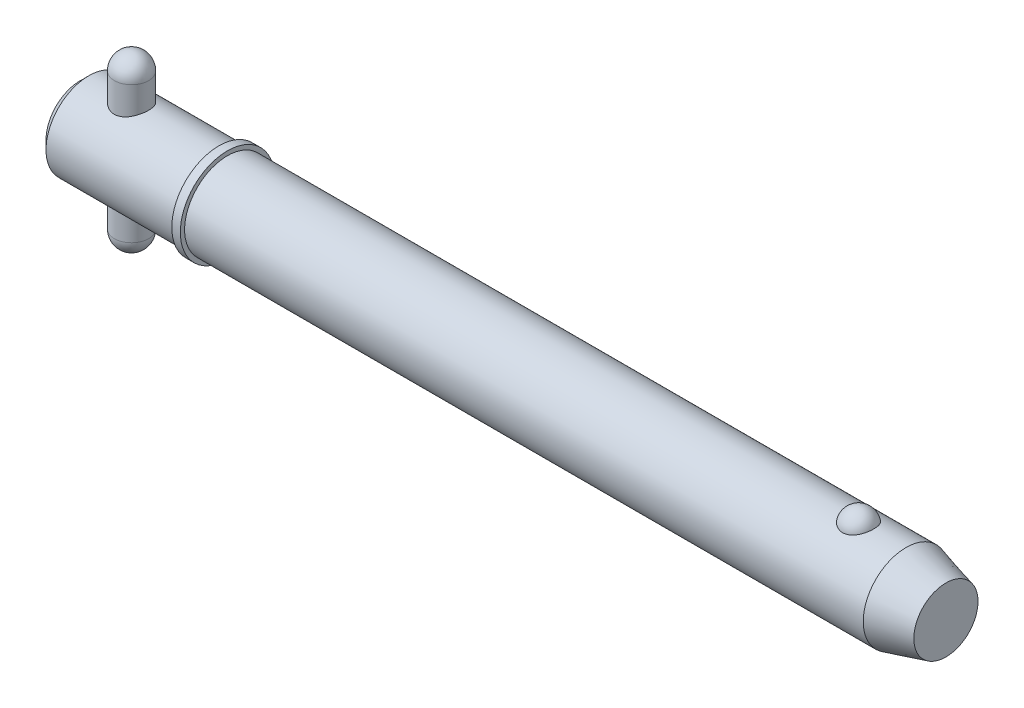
ISO-10303-21;
HEADER;
FILE_DESCRIPTION(('STEP AP214'),'2;1');
FILE_NAME('part.step','',(''),(''),'','','');
FILE_SCHEMA(('AUTOMOTIVE_DESIGN { 1 0 10303 214 1 1 1 1 }'));
ENDSEC;
DATA;
#1=APPLICATION_CONTEXT('core data for automotive mechanical design processes');
#2=APPLICATION_PROTOCOL_DEFINITION('international standard','automotive_design',2000,#1);
#3=PRODUCT_CONTEXT('',#1,'mechanical');
#4=PRODUCT('Part','Part','',(#3));
#5=PRODUCT_RELATED_PRODUCT_CATEGORY('part','',(#4));
#6=PRODUCT_DEFINITION_FORMATION('','',#4);
#7=PRODUCT_DEFINITION_CONTEXT('part definition',#1,'design');
#8=PRODUCT_DEFINITION('design','',#6,#7);
#9=PRODUCT_DEFINITION_SHAPE('','',#8);
#10=(LENGTH_UNIT() NAMED_UNIT(*) SI_UNIT(.MILLI.,.METRE.));
#11=(NAMED_UNIT(*) PLANE_ANGLE_UNIT() SI_UNIT($,.RADIAN.));
#12=(NAMED_UNIT(*) SI_UNIT($,.STERADIAN.) SOLID_ANGLE_UNIT());
#13=UNCERTAINTY_MEASURE_WITH_UNIT(LENGTH_MEASURE(1.E-05),#10,'distance_accuracy_value','');
#14=(GEOMETRIC_REPRESENTATION_CONTEXT(3) GLOBAL_UNCERTAINTY_ASSIGNED_CONTEXT((#13)) GLOBAL_UNIT_ASSIGNED_CONTEXT((#10,
#11,#12)) REPRESENTATION_CONTEXT('',''));
#15=CARTESIAN_POINT('',(0.,0.,0.));
#16=DIRECTION('',(0.,0.,1.));
#17=DIRECTION('',(1.,0.,0.));
#18=AXIS2_PLACEMENT_3D('',#15,#16,#17);
#19=CARTESIAN_POINT('',(9.525,15.875,0.));
#20=DIRECTION('',(0.,-1.,0.));
#21=DIRECTION('',(0.,0.,-1.));
#22=AXIS2_PLACEMENT_3D('',#19,#20,#21);
#23=CYLINDRICAL_SURFACE('',#22,3.175);
#24=CARTESIAN_POINT('',(9.525,-12.7,0.));
#25=DIRECTION('',(0.,-1.,0.));
#26=DIRECTION('',(0.,0.,-1.));
#27=AXIS2_PLACEMENT_3D('',#24,#25,#26);
#28=CIRCLE('',#27,3.175);
#29=CARTESIAN_POINT('',(9.525,-12.7,-3.175));
#30=VERTEX_POINT('',#29);
#31=EDGE_CURVE('P0_E10',#30,#30,#28,.F.);
#32=ORIENTED_EDGE('',*,*,#31,.T.);
#33=EDGE_LOOP('',(#32));
#34=FACE_BOUND('',#33,.T.);
#35=CARTESIAN_POINT('',(9.525,12.7,0.));
#36=DIRECTION('',(0.,-1.,0.));
#37=DIRECTION('',(0.,0.,-1.));
#38=AXIS2_PLACEMENT_3D('',#35,#36,#37);
#39=CIRCLE('',#38,3.175);
#40=CARTESIAN_POINT('',(9.525,12.7,-3.175));
#41=VERTEX_POINT('',#40);
#42=EDGE_CURVE('P0_E21',#41,#41,#39,.T.);
#43=ORIENTED_EDGE('',*,*,#42,.T.);
#44=EDGE_LOOP('',(#43));
#45=FACE_BOUND('',#44,.T.);
#46=ADVANCED_FACE('P0_F14',(#34,#45),#23,.T.);
#47=CARTESIAN_POINT('',(9.525,-12.7,0.));
#48=DIRECTION('',(0.,0.,1.));
#49=DIRECTION('',(1.,0.,0.));
#50=AXIS2_PLACEMENT_3D('',#47,#48,#49);
#51=SPHERICAL_SURFACE('',#50,3.175);
#52=CARTESIAN_POINT('',(9.525,-12.7,0.));
#53=DIRECTION('',(0.,-1.,0.));
#54=DIRECTION('',(0.,0.,-1.));
#55=AXIS2_PLACEMENT_3D('',#52,#53,#54);
#56=SPHERICAL_SURFACE('',#55,3.175);
#57=ORIENTED_EDGE('',*,*,#31,.F.);
#58=EDGE_LOOP('',(#57));
#59=FACE_BOUND('',#58,.T.);
#60=ADVANCED_FACE('P0_F29',(#59),#56,.T.);
#61=CARTESIAN_POINT('',(9.525,12.7,0.));
#62=DIRECTION('',(0.,0.,1.));
#63=DIRECTION('',(1.,0.,0.));
#64=AXIS2_PLACEMENT_3D('',#61,#62,#63);
#65=SPHERICAL_SURFACE('',#64,3.175);
#66=CARTESIAN_POINT('',(9.525,12.7,0.));
#67=DIRECTION('',(0.,-1.,0.));
#68=DIRECTION('',(0.,0.,-1.));
#69=AXIS2_PLACEMENT_3D('',#66,#67,#68);
#70=SPHERICAL_SURFACE('',#69,3.175);
#71=ORIENTED_EDGE('',*,*,#42,.F.);
#72=EDGE_LOOP('',(#71));
#73=FACE_BOUND('',#72,.T.);
#74=ADVANCED_FACE('P0_F16',(#73),#70,.T.);
#75=CLOSED_SHELL('',(#46,#60,#74));
#76=MANIFOLD_SOLID_BREP('P0_B1',#75);
#77=CARTESIAN_POINT('',(0.,0.,0.));
#78=DIRECTION('',(1.,0.,0.));
#79=DIRECTION('',(0.,0.,-1.));
#80=AXIS2_PLACEMENT_3D('',#77,#78,#79);
#81=CYLINDRICAL_SURFACE('',#80,7.94);
#82=CARTESIAN_POINT('',(153.251879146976,0.,0.));
#83=DIRECTION('',(1.,0.,0.));
#84=DIRECTION('',(0.,0.,-1.));
#85=AXIS2_PLACEMENT_3D('',#82,#83,#84);
#86=CIRCLE('',#85,7.94);
#87=CARTESIAN_POINT('',(153.251879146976,0.,-7.94));
#88=VERTEX_POINT('',#87);
#89=EDGE_CURVE('P1_E81',#88,#88,#86,.T.);
#90=ORIENTED_EDGE('',*,*,#89,.F.);
#91=EDGE_LOOP('',(#90));
#92=FACE_BOUND('',#91,.T.);
#93=CARTESIAN_POINT('',(27.31,0.,0.));
#94=DIRECTION('',(1.,0.,0.));
#95=DIRECTION('',(0.,0.,-1.));
#96=AXIS2_PLACEMENT_3D('',#93,#94,#95);
#97=CIRCLE('',#96,7.94);
#98=CARTESIAN_POINT('',(27.31,0.,-7.94));
#99=VERTEX_POINT('',#98);
#100=EDGE_CURVE('P1_E85',#99,#99,#97,.T.);
#101=ORIENTED_EDGE('',*,*,#100,.T.);
#102=EDGE_LOOP('',(#101));
#103=FACE_BOUND('',#102,.T.);
#104=CARTESIAN_POINT('',(144.444907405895,7.37767842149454,2.93486986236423));
#105=CARTESIAN_POINT('',(144.292749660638,7.3776732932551,2.93487505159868));
#106=CARTESIAN_POINT('',(144.140632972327,7.38258419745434,2.92262454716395));
#107=CARTESIAN_POINT('',(143.840928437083,7.40163229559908,2.87404196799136));
#108=CARTESIAN_POINT('',(143.693339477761,7.41576720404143,2.83771585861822));
#109=CARTESIAN_POINT('',(143.407018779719,7.45161576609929,2.74218769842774));
#110=CARTESIAN_POINT('',(143.268274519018,7.47331841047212,2.68301886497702));
#111=CARTESIAN_POINT('',(143.002882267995,7.52194082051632,2.54350967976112));
#112=CARTESIAN_POINT('',(142.876236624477,7.54886159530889,2.46316523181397));
#113=CARTESIAN_POINT('',(142.634534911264,7.60594671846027,2.28090375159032));
#114=CARTESIAN_POINT('',(142.519906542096,7.63618114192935,2.1784421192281));
#115=CARTESIAN_POINT('',(142.308878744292,7.69614046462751,1.95608495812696));
#116=CARTESIAN_POINT('',(142.212482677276,7.72586526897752,1.83618622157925));
#117=CARTESIAN_POINT('',(142.035938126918,7.78314821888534,1.57628086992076));
#118=CARTESIAN_POINT('',(141.956707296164,7.81055035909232,1.43561546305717));
#119=CARTESIAN_POINT('',(141.821797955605,7.85879631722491,1.14236334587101));
#120=CARTESIAN_POINT('',(141.766121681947,7.87963951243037,0.989775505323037));
#121=CARTESIAN_POINT('',(141.67881215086,7.91289645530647,0.674619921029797));
#122=CARTESIAN_POINT('',(141.64753090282,7.92518652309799,0.511941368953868));
#123=CARTESIAN_POINT('',(141.610975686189,7.93958930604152,0.183247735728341));
#124=CARTESIAN_POINT('',(141.605701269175,7.94170219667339,0.0172327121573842));
#125=CARTESIAN_POINT('',(141.621231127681,7.93554931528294,-0.312672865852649));
#126=CARTESIAN_POINT('',(141.641925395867,7.92732732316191,-0.476569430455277));
#127=CARTESIAN_POINT('',(141.70878655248,7.90141534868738,-0.79830524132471));
#128=CARTESIAN_POINT('',(141.754953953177,7.88372517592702,-0.956144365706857));
#129=CARTESIAN_POINT('',(141.871898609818,7.84066230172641,-1.26152073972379));
#130=CARTESIAN_POINT('',(141.942704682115,7.81528060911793,-1.40904568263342));
#131=CARTESIAN_POINT('',(142.107478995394,7.75948672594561,-1.68950598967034));
#132=CARTESIAN_POINT('',(142.201448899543,7.72907417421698,-1.82244030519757));
#133=CARTESIAN_POINT('',(142.410839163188,7.66640424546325,-2.07032792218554));
#134=CARTESIAN_POINT('',(142.526315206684,7.63414223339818,-2.18523308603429));
#135=CARTESIAN_POINT('',(142.7759006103,7.57149681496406,-2.39329737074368));
#136=CARTESIAN_POINT('',(142.910008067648,7.54111321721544,-2.48645870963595));
#137=CARTESIAN_POINT('',(143.190111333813,7.48650742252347,-2.64628132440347));
#138=CARTESIAN_POINT('',(143.335760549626,7.46215900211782,-2.71350554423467));
#139=CARTESIAN_POINT('',(143.637425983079,7.42171253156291,-2.82226614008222));
#140=CARTESIAN_POINT('',(143.793438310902,7.40561140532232,-2.86381209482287));
#141=CARTESIAN_POINT('',(144.102970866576,7.3842679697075,-2.9183907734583));
#142=CARTESIAN_POINT('',(144.256222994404,7.37852109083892,-2.93275024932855));
#143=CARTESIAN_POINT('',(144.563070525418,7.37700973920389,-2.93655208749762));
#144=CARTESIAN_POINT('',(144.716665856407,7.38124333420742,-2.92599927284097));
#145=CARTESIAN_POINT('',(145.014990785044,7.39890635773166,-2.88102897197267));
#146=CARTESIAN_POINT('',(145.159848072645,7.41205491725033,-2.84733999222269));
#147=CARTESIAN_POINT('',(145.44164329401,7.445801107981,-2.75788206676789));
#148=CARTESIAN_POINT('',(145.578580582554,7.46639934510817,-2.70211132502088));
#149=CARTESIAN_POINT('',(145.844061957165,7.51339098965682,-2.56858908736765));
#150=CARTESIAN_POINT('',(145.972354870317,7.53990200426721,-2.4903806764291));
#151=CARTESIAN_POINT('',(146.214244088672,7.59569503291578,-2.31462737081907));
#152=CARTESIAN_POINT('',(146.327837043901,7.6249776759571,-2.21707808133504));
#153=CARTESIAN_POINT('',(146.54322156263,7.68489473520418,-1.99982049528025));
#154=CARTESIAN_POINT('',(146.644148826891,7.71552419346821,-1.87925337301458));
#155=CARTESIAN_POINT('',(146.825186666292,7.77353016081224,-1.6226882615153));
#156=CARTESIAN_POINT('',(146.905293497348,7.80090608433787,-1.48668750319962));
#157=CARTESIAN_POINT('',(147.045361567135,7.85047992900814,-1.1981841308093));
#158=CARTESIAN_POINT('',(147.104587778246,7.87248183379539,-1.04529016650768));
#159=CARTESIAN_POINT('',(147.197982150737,7.90785114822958,-0.731080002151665));
#160=CARTESIAN_POINT('',(147.232149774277,7.92121837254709,-0.569763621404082));
#161=CARTESIAN_POINT('',(147.274795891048,7.93797834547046,-0.242812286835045));
#162=CARTESIAN_POINT('',(147.283204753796,7.94134405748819,-0.0771668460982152));
#163=CARTESIAN_POINT('',(147.273962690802,7.93767937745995,0.253276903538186));
#164=CARTESIAN_POINT('',(147.256312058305,7.93064910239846,0.418075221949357));
#165=CARTESIAN_POINT('',(147.195424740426,7.90695571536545,0.741525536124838));
#166=CARTESIAN_POINT('',(147.152281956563,7.8903279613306,0.900197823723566));
#167=CARTESIAN_POINT('',(147.04135358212,7.84916386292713,1.20759654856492));
#168=CARTESIAN_POINT('',(146.97356656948,7.82462706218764,1.35632241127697));
#169=CARTESIAN_POINT('',(146.814371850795,7.77006699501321,1.64032869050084));
#170=CARTESIAN_POINT('',(146.722861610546,7.74002008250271,1.7755471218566));
#171=CARTESIAN_POINT('',(146.518296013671,7.67774175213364,2.0280064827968));
#172=CARTESIAN_POINT('',(146.405241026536,7.64551037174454,2.14524772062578));
#173=CARTESIAN_POINT('',(146.160831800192,7.58265895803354,2.35778002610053));
#174=CARTESIAN_POINT('',(146.029583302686,7.5520309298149,2.45319004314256));
#175=CARTESIAN_POINT('',(145.751601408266,7.49579792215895,2.61999897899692));
#176=CARTESIAN_POINT('',(145.604867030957,7.4701932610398,2.69139637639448));
#177=CARTESIAN_POINT('',(145.292947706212,7.42622216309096,2.8105324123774));
#178=CARTESIAN_POINT('',(145.127220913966,7.40825002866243,2.85700910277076));
#179=CARTESIAN_POINT('',(144.789279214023,7.38398348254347,2.9191685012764));
#180=CARTESIAN_POINT('',(144.61706702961,7.3776842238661,2.93486399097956));
#181=CARTESIAN_POINT('',(144.444907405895,7.37767842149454,2.93486986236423));
#182=B_SPLINE_CURVE_WITH_KNOTS('',3,(#104,#105,#106,#107,#108,#109,#110,#111,#112,#113,#114,
#115,#116,#117,#118,#119,#120,#121,#122,#123,#124,#125,#126,#127,#128,#129,#130,#131,#132,#133,
#134,#135,#136,#137,#138,#139,#140,#141,#142,#143,#144,#145,#146,#147,#148,#149,#150,#151,#152,
#153,#154,#155,#156,#157,#158,#159,#160,#161,#162,#163,#164,#165,#166,#167,#168,#169,#170,#171,
#172,#173,#174,#175,#176,#177,#178,#179,#180,#181),.UNSPECIFIED.,.T.,.F.,(4,2,2,2,2,2,2,2,2,2,2,
2,2,2,2,2,2,2,2,2,2,2,2,2,2,2,2,2,2,2,2,2,2,2,2,2,2,2,4),(0.,0.455841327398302,
0.911569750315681,1.36663794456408,1.82179423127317,2.2897898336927,2.75787163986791,
3.24685368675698,3.73588214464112,4.23184282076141,4.72779494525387,5.22165321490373,
5.71552141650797,6.20996917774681,6.7044524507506,7.20023431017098,7.69596557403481,
8.18023418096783,8.66432203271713,9.12410697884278,9.58380291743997,10.0296503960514,
10.4755341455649,10.9312349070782,11.3870393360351,11.8654416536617,12.3439299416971,
12.8378875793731,13.3318558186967,13.8271581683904,14.3224549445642,14.8159385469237,
15.3094506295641,15.8051323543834,16.3008055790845,16.7937101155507,17.2866458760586,
17.8026240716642,18.3183879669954),.UNSPECIFIED.);
#183=CARTESIAN_POINT('',(144.444907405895,7.37767842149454,2.93486986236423));
#184=VERTEX_POINT('',#183);
#185=EDGE_CURVE('P1_E35',#184,#184,#182,.T.);
#186=ORIENTED_EDGE('',*,*,#185,.T.);
#187=EDGE_LOOP('',(#186));
#188=FACE_BOUND('',#187,.T.);
#189=ADVANCED_FACE('P1_F13',(#92,#103,#188),#81,.T.);
#190=CARTESIAN_POINT('',(0.,0.,0.));
#191=DIRECTION('',(-1.,0.,0.));
#192=DIRECTION('',(0.,0.,1.));
#193=AXIS2_PLACEMENT_3D('',#190,#191,#192);
#194=PLANE('',#193);
#195=CARTESIAN_POINT('',(0.,0.,0.));
#196=DIRECTION('',(1.,0.,0.));
#197=DIRECTION('',(0.,0.,-1.));
#198=AXIS2_PLACEMENT_3D('',#195,#196,#197);
#199=CIRCLE('',#198,6.352);
#200=CARTESIAN_POINT('',(0.,0.,-6.352));
#201=VERTEX_POINT('',#200);
#202=EDGE_CURVE('P1_E9',#201,#201,#199,.T.);
#203=ORIENTED_EDGE('',*,*,#202,.F.);
#204=EDGE_LOOP('',(#203));
#205=FACE_BOUND('',#204,.T.);
#206=ADVANCED_FACE('P1_F15',(#205),#194,.T.);
#207=CARTESIAN_POINT('',(1.58799999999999,0.,0.));
#208=DIRECTION('',(1.,0.,0.));
#209=DIRECTION('',(0.,0.,-1.));
#210=AXIS2_PLACEMENT_3D('',#207,#208,#209);
#211=CONICAL_SURFACE('',#210,7.94,0.78539816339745);
#212=ORIENTED_EDGE('',*,*,#202,.T.);
#213=EDGE_LOOP('',(#212));
#214=FACE_BOUND('',#213,.T.);
#215=CARTESIAN_POINT('',(1.58799999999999,0.,0.));
#216=DIRECTION('',(1.,0.,0.));
#217=DIRECTION('',(0.,0.,-1.));
#218=AXIS2_PLACEMENT_3D('',#215,#216,#217);
#219=CIRCLE('',#218,7.94);
#220=CARTESIAN_POINT('',(1.58799999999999,0.,-7.94));
#221=VERTEX_POINT('',#220);
#222=EDGE_CURVE('P1_E26',#221,#221,#219,.T.);
#223=ORIENTED_EDGE('',*,*,#222,.F.);
#224=EDGE_LOOP('',(#223));
#225=FACE_BOUND('',#224,.T.);
#226=ADVANCED_FACE('P1_F77',(#214,#225),#211,.T.);
#227=CARTESIAN_POINT('',(0.,0.,0.));
#228=DIRECTION('',(1.,0.,0.));
#229=DIRECTION('',(0.,0.,-1.));
#230=AXIS2_PLACEMENT_3D('',#227,#228,#229);
#231=CYLINDRICAL_SURFACE('',#230,7.94);
#232=CARTESIAN_POINT('',(9.525,-7.27756655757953,3.175));
#233=CARTESIAN_POINT('',(9.43992346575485,-7.27756715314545,3.17499935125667));
#234=CARTESIAN_POINT('',(9.35481882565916,-7.27906496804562,3.1715736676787));
#235=CARTESIAN_POINT('',(9.18524505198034,-7.28499816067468,3.15791803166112));
#236=CARTESIAN_POINT('',(9.100776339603,-7.28943533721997,3.14768391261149));
#237=CARTESIAN_POINT('',(8.84895715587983,-7.30698881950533,3.10684226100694));
#238=CARTESIAN_POINT('',(8.6834173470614,-7.32434654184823,3.06609574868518));
#239=CARTESIAN_POINT('',(8.36278910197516,-7.36806950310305,2.95945910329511));
#240=CARTESIAN_POINT('',(8.20766386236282,-7.39440078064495,2.89366366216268));
#241=CARTESIAN_POINT('',(7.91065319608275,-7.45304562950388,2.73907413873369));
#242=CARTESIAN_POINT('',(7.76876488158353,-7.48535789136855,2.65028508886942));
#243=CARTESIAN_POINT('',(7.49411086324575,-7.55439482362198,2.44679888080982));
#244=CARTESIAN_POINT('',(7.36219910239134,-7.59126138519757,2.33099745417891));
#245=CARTESIAN_POINT('',(7.11904234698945,-7.66408045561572,2.07909838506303));
#246=CARTESIAN_POINT('',(7.00780457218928,-7.70003264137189,1.94299368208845));
#247=CARTESIAN_POINT('',(6.80492173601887,-7.76867514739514,1.64775981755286));
#248=CARTESIAN_POINT('',(6.71422139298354,-7.80118112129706,1.48793473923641));
#249=CARTESIAN_POINT('',(6.56135788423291,-7.85754918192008,1.15376269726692));
#250=CARTESIAN_POINT('',(6.49918311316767,-7.88141478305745,0.979421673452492));
#251=CARTESIAN_POINT('',(6.40818142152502,-7.91680873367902,0.630115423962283));
#252=CARTESIAN_POINT('',(6.3778864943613,-7.9288781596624,0.455588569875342));
#253=CARTESIAN_POINT('',(6.34677743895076,-7.94127547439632,0.103539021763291));
#254=CARTESIAN_POINT('',(6.34595232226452,-7.94160773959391,-0.0739825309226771));
#255=CARTESIAN_POINT('',(6.37300128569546,-7.93082261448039,-0.416371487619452));
#256=CARTESIAN_POINT('',(6.39926693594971,-7.92034690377,-0.581389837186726));
#257=CARTESIAN_POINT('',(6.47701615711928,-7.88998770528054,-0.904449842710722));
#258=CARTESIAN_POINT('',(6.52850157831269,-7.87010352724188,-1.06249098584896));
#259=CARTESIAN_POINT('',(6.65586120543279,-7.82249343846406,-1.36995769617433));
#260=CARTESIAN_POINT('',(6.73209124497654,-7.79465387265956,-1.51921754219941));
#261=CARTESIAN_POINT('',(6.90644286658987,-7.73389606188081,-1.80321183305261));
#262=CARTESIAN_POINT('',(7.00457194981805,-7.70097607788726,-1.93794127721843));
#263=CARTESIAN_POINT('',(7.22744086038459,-7.63084889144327,-2.19843606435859));
#264=CARTESIAN_POINT('',(7.35350432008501,-7.59350211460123,-2.3230330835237));
#265=CARTESIAN_POINT('',(7.62488266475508,-7.52039654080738,-2.54979642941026));
#266=CARTESIAN_POINT('',(7.77020381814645,-7.48463826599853,-2.65195542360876));
#267=CARTESIAN_POINT('',(8.08119298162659,-7.41780943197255,-2.83361305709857));
#268=CARTESIAN_POINT('',(8.24731937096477,-7.38689959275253,-2.91239105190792));
#269=CARTESIAN_POINT('',(8.59204539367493,-7.33515216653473,-3.04038913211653));
#270=CARTESIAN_POINT('',(8.77063684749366,-7.31430804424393,-3.08962840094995));
#271=CARTESIAN_POINT('',(9.12356982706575,-7.28663831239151,-3.15431018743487));
#272=CARTESIAN_POINT('',(9.29750494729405,-7.2790344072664,-3.17163284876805));
#273=CARTESIAN_POINT('',(9.64592502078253,-7.27648884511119,-3.17747282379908));
#274=CARTESIAN_POINT('',(9.82040979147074,-7.28154335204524,-3.16599886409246));
#275=CARTESIAN_POINT('',(10.1545374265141,-7.30294638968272,-3.11628310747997));
#276=CARTESIAN_POINT('',(10.3144598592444,-7.31863587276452,-3.0796016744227));
#277=CARTESIAN_POINT('',(10.625774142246,-7.35872371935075,-2.98253618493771));
#278=CARTESIAN_POINT('',(10.7771640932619,-7.38312401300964,-2.92214687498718));
#279=CARTESIAN_POINT('',(11.0739599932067,-7.4390944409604,-2.77664664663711));
#280=CARTESIAN_POINT('',(11.2188745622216,-7.47091513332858,-2.69063278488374));
#281=CARTESIAN_POINT('',(11.4928722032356,-7.53775867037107,-2.49724834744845));
#282=CARTESIAN_POINT('',(11.6219487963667,-7.57278281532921,-2.38986907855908));
#283=CARTESIAN_POINT('',(11.8705091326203,-7.64520845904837,-2.1474449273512));
#284=CARTESIAN_POINT('',(11.9885816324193,-7.68259462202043,-2.01094304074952));
#285=CARTESIAN_POINT('',(12.2003631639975,-7.75309951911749,-1.71917041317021));
#286=CARTESIAN_POINT('',(12.2940712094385,-7.78621808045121,-1.56389891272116));
#287=CARTESIAN_POINT('',(12.4541161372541,-7.84456050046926,-1.23845027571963));
#288=CARTESIAN_POINT('',(12.5204600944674,-7.86978639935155,-1.06827700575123));
#289=CARTESIAN_POINT('',(12.6231407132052,-7.90943635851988,-0.717928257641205));
#290=CARTESIAN_POINT('',(12.6594936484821,-7.92386627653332,-0.537758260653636));
#291=CARTESIAN_POINT('',(12.6992281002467,-7.93967263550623,-0.185201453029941));
#292=CARTESIAN_POINT('',(12.7046050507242,-7.94183891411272,-0.0130732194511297));
#293=CARTESIAN_POINT('',(12.6875036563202,-7.9350072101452,0.329549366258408));
#294=CARTESIAN_POINT('',(12.6650295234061,-7.92601091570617,0.500043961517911));
#295=CARTESIAN_POINT('',(12.5942896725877,-7.89825976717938,0.829196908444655));
#296=CARTESIAN_POINT('',(12.5468364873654,-7.87981280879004,0.988057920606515));
#297=CARTESIAN_POINT('',(12.4283390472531,-7.83513565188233,1.29553461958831));
#298=CARTESIAN_POINT('',(12.3572904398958,-7.8089040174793,1.44414841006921));
#299=CARTESIAN_POINT('',(12.1900822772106,-7.7497911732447,1.73412879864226));
#300=CARTESIAN_POINT('',(12.0929519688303,-7.71666737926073,1.87488510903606));
#301=CARTESIAN_POINT('',(11.8777894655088,-7.64775894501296,2.13869231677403));
#302=CARTESIAN_POINT('',(11.7597486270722,-7.61197320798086,2.26173585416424));
#303=CARTESIAN_POINT('',(11.4974896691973,-7.53902341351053,2.49449755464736));
#304=CARTESIAN_POINT('',(11.3521039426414,-7.50191102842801,2.60292060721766));
#305=CARTESIAN_POINT('',(11.0440201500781,-7.43289551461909,2.79392602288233));
#306=CARTESIAN_POINT('',(10.8813200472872,-7.40099299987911,2.87650534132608));
#307=CARTESIAN_POINT('',(10.558064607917,-7.3489506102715,3.00682739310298));
#308=CARTESIAN_POINT('',(10.398627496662,-7.32801197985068,3.05703164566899));
#309=CARTESIAN_POINT('',(10.0731242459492,-7.29639491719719,3.13175843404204));
#310=CARTESIAN_POINT('',(9.90707793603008,-7.28568789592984,3.15635254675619));
#311=CARTESIAN_POINT('',(9.70441566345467,-7.27968826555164,3.17013149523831));
#312=CARTESIAN_POINT('',(9.66856669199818,-7.27889378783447,3.17195593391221));
#313=CARTESIAN_POINT('',(9.59681348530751,-7.27783278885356,3.17439036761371));
#314=CARTESIAN_POINT('',(9.56090924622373,-7.27756630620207,3.17500027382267));
#315=CARTESIAN_POINT('',(9.525,-7.27756655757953,3.175));
#316=B_SPLINE_CURVE_WITH_KNOTS('',3,(#232,#233,#234,#235,#236,#237,#238,#239,#240,#241,#242,
#243,#244,#245,#246,#247,#248,#249,#250,#251,#252,#253,#254,#255,#256,#257,#258,#259,#260,#261,
#262,#263,#264,#265,#266,#267,#268,#269,#270,#271,#272,#273,#274,#275,#276,#277,#278,#279,#280,
#281,#282,#283,#284,#285,#286,#287,#288,#289,#290,#291,#292,#293,#294,#295,#296,#297,#298,#299,
#300,#301,#302,#303,#304,#305,#306,#307,#308,#309,#310,#311,#312,#313,#314,#315),.UNSPECIFIED.,
.T.,.F.,(4,2,2,2,2,2,2,2,2,2,2,2,2,2,2,2,2,2,2,2,2,2,2,2,2,2,2,2,2,2,2,2,2,2,2,2,2,2,2,2,2,4),
(0.,0.255187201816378,0.510530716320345,1.0218798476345,1.53131482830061,2.04063840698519,
2.57635929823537,3.11226692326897,3.66929090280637,4.22608806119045,4.75594400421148,
5.28560237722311,5.78552836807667,6.28549104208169,6.79298787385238,7.30065880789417,
7.8416422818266,8.38280228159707,8.93923025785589,9.49529647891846,10.0174074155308,
10.5393601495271,11.0316114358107,11.5239718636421,12.0362920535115,12.5488211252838,
13.0991799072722,13.6495609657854,14.1997996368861,14.7497395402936,15.2638187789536,
15.7778202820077,16.2760504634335,16.7743726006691,17.294711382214,17.8152657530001,
18.3680208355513,18.9208410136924,19.4240423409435,19.9258334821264,20.0335354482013,
20.1412452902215),.UNSPECIFIED.);
#317=CARTESIAN_POINT('',(9.525,-7.27756655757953,3.175));
#318=VERTEX_POINT('',#317);
#319=EDGE_CURVE('P1_E17',#318,#318,#316,.T.);
#320=ORIENTED_EDGE('',*,*,#319,.F.);
#321=EDGE_LOOP('',(#320));
#322=FACE_BOUND('',#321,.T.);
#323=CARTESIAN_POINT('',(9.525,7.27756655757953,3.175));
#324=CARTESIAN_POINT('',(9.61007653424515,7.27756715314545,3.17499935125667));
#325=CARTESIAN_POINT('',(9.69518117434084,7.27906496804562,3.1715736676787));
#326=CARTESIAN_POINT('',(9.86475494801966,7.28499816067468,3.15791803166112));
#327=CARTESIAN_POINT('',(9.949223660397,7.28943533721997,3.14768391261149));
#328=CARTESIAN_POINT('',(10.2010428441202,7.30698881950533,3.10684226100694));
#329=CARTESIAN_POINT('',(10.3665826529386,7.32434654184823,3.06609574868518));
#330=CARTESIAN_POINT('',(10.6872108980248,7.36806950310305,2.95945910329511));
#331=CARTESIAN_POINT('',(10.8423361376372,7.39440078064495,2.89366366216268));
#332=CARTESIAN_POINT('',(11.1393468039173,7.45304562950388,2.73907413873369));
#333=CARTESIAN_POINT('',(11.2812351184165,7.48535789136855,2.65028508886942));
#334=CARTESIAN_POINT('',(11.5558891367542,7.55439482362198,2.44679888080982));
#335=CARTESIAN_POINT('',(11.6878008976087,7.59126138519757,2.33099745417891));
#336=CARTESIAN_POINT('',(11.9309576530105,7.66408045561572,2.07909838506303));
#337=CARTESIAN_POINT('',(12.0421954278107,7.70003264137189,1.94299368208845));
#338=CARTESIAN_POINT('',(12.2450782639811,7.76867514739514,1.64775981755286));
#339=CARTESIAN_POINT('',(12.3357786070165,7.80118112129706,1.48793473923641));
#340=CARTESIAN_POINT('',(12.4886421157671,7.85754918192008,1.15376269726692));
#341=CARTESIAN_POINT('',(12.5508168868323,7.88141478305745,0.979421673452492));
#342=CARTESIAN_POINT('',(12.641818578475,7.91680873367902,0.630115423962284));
#343=CARTESIAN_POINT('',(12.6721135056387,7.9288781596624,0.455588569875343));
#344=CARTESIAN_POINT('',(12.7032225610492,7.94127547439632,0.103539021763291));
#345=CARTESIAN_POINT('',(12.7040476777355,7.94160773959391,-0.0739825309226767));
#346=CARTESIAN_POINT('',(12.6769987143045,7.93082261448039,-0.416371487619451));
#347=CARTESIAN_POINT('',(12.6507330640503,7.92034690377,-0.581389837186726));
#348=CARTESIAN_POINT('',(12.5729838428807,7.88998770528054,-0.904449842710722));
#349=CARTESIAN_POINT('',(12.5214984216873,7.87010352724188,-1.06249098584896));
#350=CARTESIAN_POINT('',(12.3941387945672,7.82249343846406,-1.36995769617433));
#351=CARTESIAN_POINT('',(12.3179087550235,7.79465387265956,-1.51921754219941));
#352=CARTESIAN_POINT('',(12.1435571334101,7.73389606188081,-1.80321183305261));
#353=CARTESIAN_POINT('',(12.0454280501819,7.70097607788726,-1.93794127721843));
#354=CARTESIAN_POINT('',(11.8225591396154,7.63084889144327,-2.19843606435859));
#355=CARTESIAN_POINT('',(11.696495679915,7.59350211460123,-2.3230330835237));
#356=CARTESIAN_POINT('',(11.4251173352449,7.52039654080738,-2.54979642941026));
#357=CARTESIAN_POINT('',(11.2797961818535,7.48463826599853,-2.65195542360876));
#358=CARTESIAN_POINT('',(10.9688070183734,7.41780943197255,-2.83361305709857));
#359=CARTESIAN_POINT('',(10.8026806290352,7.38689959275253,-2.91239105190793));
#360=CARTESIAN_POINT('',(10.4579546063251,7.33515216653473,-3.04038913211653));
#361=CARTESIAN_POINT('',(10.2793631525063,7.31430804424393,-3.08962840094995));
#362=CARTESIAN_POINT('',(9.92643017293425,7.28663831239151,-3.15431018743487));
#363=CARTESIAN_POINT('',(9.75249505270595,7.2790344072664,-3.17163284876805));
#364=CARTESIAN_POINT('',(9.40407497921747,7.2764888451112,-3.17747282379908));
#365=CARTESIAN_POINT('',(9.22959020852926,7.28154335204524,-3.16599886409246));
#366=CARTESIAN_POINT('',(8.89546257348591,7.30294638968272,-3.11628310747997));
#367=CARTESIAN_POINT('',(8.73554014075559,7.31863587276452,-3.0796016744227));
#368=CARTESIAN_POINT('',(8.42422585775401,7.35872371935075,-2.98253618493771));
#369=CARTESIAN_POINT('',(8.27283590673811,7.38312401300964,-2.92214687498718));
#370=CARTESIAN_POINT('',(7.97604000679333,7.4390944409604,-2.77664664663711));
#371=CARTESIAN_POINT('',(7.83112543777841,7.47091513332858,-2.69063278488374));
#372=CARTESIAN_POINT('',(7.55712779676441,7.53775867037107,-2.49724834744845));
#373=CARTESIAN_POINT('',(7.42805120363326,7.57278281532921,-2.38986907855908));
#374=CARTESIAN_POINT('',(7.17949086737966,7.64520845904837,-2.1474449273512));
#375=CARTESIAN_POINT('',(7.06141836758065,7.68259462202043,-2.01094304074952));
#376=CARTESIAN_POINT('',(6.8496368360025,7.75309951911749,-1.71917041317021));
#377=CARTESIAN_POINT('',(6.75592879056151,7.78621808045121,-1.56389891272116));
#378=CARTESIAN_POINT('',(6.59588386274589,7.84456050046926,-1.23845027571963));
#379=CARTESIAN_POINT('',(6.52953990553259,7.86978639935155,-1.06827700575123));
#380=CARTESIAN_POINT('',(6.42685928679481,7.90943635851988,-0.717928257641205));
#381=CARTESIAN_POINT('',(6.39050635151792,7.92386627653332,-0.537758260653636));
#382=CARTESIAN_POINT('',(6.35077189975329,7.93967263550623,-0.18520145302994));
#383=CARTESIAN_POINT('',(6.34539494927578,7.94183891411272,-0.0130732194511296));
#384=CARTESIAN_POINT('',(6.36249634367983,7.9350072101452,0.329549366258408));
#385=CARTESIAN_POINT('',(6.38497047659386,7.92601091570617,0.500043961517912));
#386=CARTESIAN_POINT('',(6.45571032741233,7.89825976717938,0.829196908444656));
#387=CARTESIAN_POINT('',(6.50316351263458,7.87981280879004,0.988057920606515));
#388=CARTESIAN_POINT('',(6.62166095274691,7.83513565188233,1.29553461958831));
#389=CARTESIAN_POINT('',(6.69270956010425,7.8089040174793,1.44414841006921));
#390=CARTESIAN_POINT('',(6.85991772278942,7.7497911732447,1.73412879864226));
#391=CARTESIAN_POINT('',(6.95704803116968,7.71666737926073,1.87488510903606));
#392=CARTESIAN_POINT('',(7.17221053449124,7.64775894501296,2.13869231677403));
#393=CARTESIAN_POINT('',(7.29025137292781,7.61197320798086,2.26173585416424));
#394=CARTESIAN_POINT('',(7.55251033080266,7.53902341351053,2.49449755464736));
#395=CARTESIAN_POINT('',(7.69789605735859,7.50191102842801,2.60292060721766));
#396=CARTESIAN_POINT('',(8.00597984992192,7.43289551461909,2.79392602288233));
#397=CARTESIAN_POINT('',(8.16867995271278,7.40099299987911,2.87650534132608));
#398=CARTESIAN_POINT('',(8.49193539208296,7.3489506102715,3.00682739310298));
#399=CARTESIAN_POINT('',(8.65137250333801,7.32801197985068,3.05703164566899));
#400=CARTESIAN_POINT('',(8.97687575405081,7.29639491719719,3.13175843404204));
#401=CARTESIAN_POINT('',(9.14292206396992,7.28568789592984,3.15635254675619));
#402=CARTESIAN_POINT('',(9.34558433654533,7.27968826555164,3.17013149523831));
#403=CARTESIAN_POINT('',(9.38143330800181,7.27889378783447,3.17195593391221));
#404=CARTESIAN_POINT('',(9.45318651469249,7.27783278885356,3.17439036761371));
#405=CARTESIAN_POINT('',(9.48909075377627,7.27756630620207,3.17500027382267));
#406=CARTESIAN_POINT('',(9.525,7.27756655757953,3.175));
#407=B_SPLINE_CURVE_WITH_KNOTS('',3,(#323,#324,#325,#326,#327,#328,#329,#330,#331,#332,#333,
#334,#335,#336,#337,#338,#339,#340,#341,#342,#343,#344,#345,#346,#347,#348,#349,#350,#351,#352,
#353,#354,#355,#356,#357,#358,#359,#360,#361,#362,#363,#364,#365,#366,#367,#368,#369,#370,#371,
#372,#373,#374,#375,#376,#377,#378,#379,#380,#381,#382,#383,#384,#385,#386,#387,#388,#389,#390,
#391,#392,#393,#394,#395,#396,#397,#398,#399,#400,#401,#402,#403,#404,#405,#406),.UNSPECIFIED.,
.T.,.F.,(4,2,2,2,2,2,2,2,2,2,2,2,2,2,2,2,2,2,2,2,2,2,2,2,2,2,2,2,2,2,2,2,2,2,2,2,2,2,2,2,2,4),
(0.,0.255187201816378,0.510530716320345,1.0218798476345,1.53131482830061,2.04063840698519,
2.57635929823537,3.11226692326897,3.66929090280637,4.22608806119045,4.75594400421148,
5.2856023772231,5.78552836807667,6.28549104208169,6.79298787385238,7.30065880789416,
7.8416422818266,8.38280228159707,8.9392302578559,9.49529647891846,10.0174074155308,
10.5393601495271,11.0316114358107,11.5239718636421,12.0362920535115,12.5488211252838,
13.0991799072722,13.6495609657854,14.1997996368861,14.7497395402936,15.2638187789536,
15.7778202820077,16.2760504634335,16.7743726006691,17.294711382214,17.8152657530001,
18.3680208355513,18.9208410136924,19.4240423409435,19.9258334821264,20.0335354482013,
20.1412452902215),.UNSPECIFIED.);
#408=CARTESIAN_POINT('',(9.525,7.27756655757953,3.175));
#409=VERTEX_POINT('',#408);
#410=EDGE_CURVE('P1_E43',#409,#409,#407,.T.);
#411=ORIENTED_EDGE('',*,*,#410,.F.);
#412=EDGE_LOOP('',(#411));
#413=FACE_BOUND('',#412,.T.);
#414=ORIENTED_EDGE('',*,*,#222,.T.);
#415=EDGE_LOOP('',(#414));
#416=FACE_BOUND('',#415,.T.);
#417=CARTESIAN_POINT('',(25.722,0.,0.));
#418=DIRECTION('',(1.,0.,0.));
#419=DIRECTION('',(0.,0.,-1.));
#420=AXIS2_PLACEMENT_3D('',#417,#418,#419);
#421=CIRCLE('',#420,7.94);
#422=CARTESIAN_POINT('',(25.722,0.,-7.94));
#423=VERTEX_POINT('',#422);
#424=EDGE_CURVE('P1_E31',#423,#423,#421,.T.);
#425=ORIENTED_EDGE('',*,*,#424,.F.);
#426=EDGE_LOOP('',(#425));
#427=FACE_BOUND('',#426,.T.);
#428=ADVANCED_FACE('P1_F103',(#322,#413,#416,#427),#231,.T.);
#429=CARTESIAN_POINT('',(25.722,7.94,0.));
#430=DIRECTION('',(-1.,0.,0.));
#431=DIRECTION('',(0.,0.,1.));
#432=AXIS2_PLACEMENT_3D('',#429,#430,#431);
#433=PLANE('',#432);
#434=ORIENTED_EDGE('',*,*,#424,.T.);
#435=EDGE_LOOP('',(#434));
#436=FACE_BOUND('',#435,.T.);
#437=CARTESIAN_POINT('',(25.722,0.,0.));
#438=DIRECTION('',(1.,0.,0.));
#439=DIRECTION('',(0.,0.,-1.));
#440=AXIS2_PLACEMENT_3D('',#437,#438,#439);
#441=CIRCLE('',#440,8.734);
#442=CARTESIAN_POINT('',(25.722,0.,-8.734));
#443=VERTEX_POINT('',#442);
#444=EDGE_CURVE('P1_E91',#443,#443,#441,.T.);
#445=ORIENTED_EDGE('',*,*,#444,.F.);
#446=EDGE_LOOP('',(#445));
#447=FACE_BOUND('',#446,.T.);
#448=ADVANCED_FACE('P1_F100',(#436,#447),#433,.T.);
#449=CARTESIAN_POINT('',(0.,0.,0.));
#450=DIRECTION('',(1.,0.,0.));
#451=DIRECTION('',(0.,0.,-1.));
#452=AXIS2_PLACEMENT_3D('',#449,#450,#451);
#453=CYLINDRICAL_SURFACE('',#452,8.734);
#454=ORIENTED_EDGE('',*,*,#444,.T.);
#455=EDGE_LOOP('',(#454));
#456=FACE_BOUND('',#455,.T.);
#457=CARTESIAN_POINT('',(27.31,0.,0.));
#458=DIRECTION('',(1.,0.,0.));
#459=DIRECTION('',(0.,0.,-1.));
#460=AXIS2_PLACEMENT_3D('',#457,#458,#459);
#461=CIRCLE('',#460,8.734);
#462=CARTESIAN_POINT('',(27.31,0.,-8.734));
#463=VERTEX_POINT('',#462);
#464=EDGE_CURVE('P1_E88',#463,#463,#461,.T.);
#465=ORIENTED_EDGE('',*,*,#464,.F.);
#466=EDGE_LOOP('',(#465));
#467=FACE_BOUND('',#466,.T.);
#468=ADVANCED_FACE('P1_F68',(#456,#467),#453,.T.);
#469=CARTESIAN_POINT('',(27.31,8.734,0.));
#470=DIRECTION('',(1.,0.,0.));
#471=DIRECTION('',(0.,0.,-1.));
#472=AXIS2_PLACEMENT_3D('',#469,#470,#471);
#473=PLANE('',#472);
#474=ORIENTED_EDGE('',*,*,#464,.T.);
#475=EDGE_LOOP('',(#474));
#476=FACE_BOUND('',#475,.T.);
#477=ORIENTED_EDGE('',*,*,#100,.F.);
#478=EDGE_LOOP('',(#477));
#479=FACE_BOUND('',#478,.T.);
#480=ADVANCED_FACE('P1_F62',(#476,#479),#473,.T.);
#481=CARTESIAN_POINT('',(160.66,0.,0.));
#482=DIRECTION('',(-1.,0.,0.));
#483=DIRECTION('',(0.,0.,1.));
#484=AXIS2_PLACEMENT_3D('',#481,#482,#483);
#485=CONICAL_SURFACE('',#484,5.95500000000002,0.26179938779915);
#486=ORIENTED_EDGE('',*,*,#89,.T.);
#487=EDGE_LOOP('',(#486));
#488=FACE_BOUND('',#487,.T.);
#489=CARTESIAN_POINT('',(160.66,0.,0.));
#490=DIRECTION('',(1.,0.,0.));
#491=DIRECTION('',(0.,0.,-1.));
#492=AXIS2_PLACEMENT_3D('',#489,#490,#491);
#493=CIRCLE('',#492,5.95500000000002);
#494=CARTESIAN_POINT('',(160.66,0.,-5.95500000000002));
#495=VERTEX_POINT('',#494);
#496=EDGE_CURVE('P1_E42',#495,#495,#493,.T.);
#497=ORIENTED_EDGE('',*,*,#496,.F.);
#498=EDGE_LOOP('',(#497));
#499=FACE_BOUND('',#498,.T.);
#500=ADVANCED_FACE('P1_F59',(#488,#499),#485,.T.);
#501=CARTESIAN_POINT('',(160.66,5.95500000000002,0.));
#502=DIRECTION('',(1.,0.,0.));
#503=DIRECTION('',(0.,0.,-1.));
#504=AXIS2_PLACEMENT_3D('',#501,#502,#503);
#505=PLANE('',#504);
#506=ORIENTED_EDGE('',*,*,#496,.T.);
#507=EDGE_LOOP('',(#506));
#508=FACE_BOUND('',#507,.T.);
#509=ADVANCED_FACE('P1_F55',(#508),#505,.T.);
#510=CARTESIAN_POINT('',(144.444907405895,7.146,0.));
#511=DIRECTION('',(-1.,0.,0.));
#512=DIRECTION('',(0.,1.,0.));
#513=AXIS2_PLACEMENT_3D('',#510,#511,#512);
#514=SPHERICAL_SURFACE('',#513,2.944);
#515=ORIENTED_EDGE('',*,*,#185,.F.);
#516=EDGE_LOOP('',(#515));
#517=FACE_BOUND('',#516,.T.);
#518=ADVANCED_FACE('P1_F50',(#517),#514,.T.);
#519=CARTESIAN_POINT('',(9.525,-8.734,0.));
#520=DIRECTION('',(0.,1.,0.));
#521=DIRECTION('',(0.,0.,1.));
#522=AXIS2_PLACEMENT_3D('',#519,#520,#521);
#523=CYLINDRICAL_SURFACE('',#522,3.175);
#524=ORIENTED_EDGE('',*,*,#319,.T.);
#525=EDGE_LOOP('',(#524));
#526=FACE_BOUND('',#525,.T.);
#527=ORIENTED_EDGE('',*,*,#410,.T.);
#528=EDGE_LOOP('',(#527));
#529=FACE_BOUND('',#528,.T.);
#530=ADVANCED_FACE('P1_F54',(#526,#529),#523,.F.);
#531=CLOSED_SHELL('',(#189,#206,#226,#428,#448,#468,#480,#500,#509,#518,#530));
#532=MANIFOLD_SOLID_BREP('P1_B1',#531);
#533=ADVANCED_BREP_SHAPE_REPRESENTATION('',(#18,#76,#532),#14);
#534=SHAPE_DEFINITION_REPRESENTATION(#9,#533);
ENDSEC;
END-ISO-10303-21;
